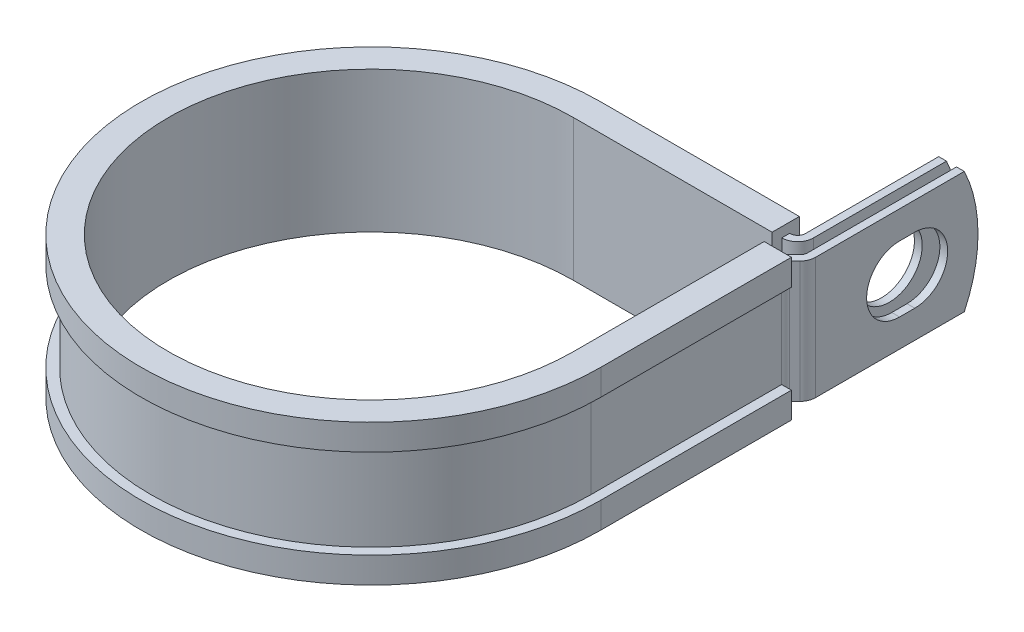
ISO-10303-21;
HEADER;
FILE_DESCRIPTION(('STEP AP214'),'2;1');
FILE_NAME('part.step','',(''),(''),'','','');
FILE_SCHEMA(('AUTOMOTIVE_DESIGN { 1 0 10303 214 1 1 1 1 }'));
ENDSEC;
DATA;
#1=APPLICATION_CONTEXT('core data for automotive mechanical design processes');
#2=APPLICATION_PROTOCOL_DEFINITION('international standard','automotive_design',2000,#1);
#3=PRODUCT_CONTEXT('',#1,'mechanical');
#4=PRODUCT('Part','Part','',(#3));
#5=PRODUCT_RELATED_PRODUCT_CATEGORY('part','',(#4));
#6=PRODUCT_DEFINITION_FORMATION('','',#4);
#7=PRODUCT_DEFINITION_CONTEXT('part definition',#1,'design');
#8=PRODUCT_DEFINITION('design','',#6,#7);
#9=PRODUCT_DEFINITION_SHAPE('','',#8);
#10=(LENGTH_UNIT() NAMED_UNIT(*) SI_UNIT(.MILLI.,.METRE.));
#11=(NAMED_UNIT(*) PLANE_ANGLE_UNIT() SI_UNIT($,.RADIAN.));
#12=(NAMED_UNIT(*) SI_UNIT($,.STERADIAN.) SOLID_ANGLE_UNIT());
#13=UNCERTAINTY_MEASURE_WITH_UNIT(LENGTH_MEASURE(1.E-05),#10,'distance_accuracy_value','');
#14=(GEOMETRIC_REPRESENTATION_CONTEXT(3) GLOBAL_UNCERTAINTY_ASSIGNED_CONTEXT((#13)) GLOBAL_UNIT_ASSIGNED_CONTEXT((#10,
#11,#12)) REPRESENTATION_CONTEXT('',''));
#15=CARTESIAN_POINT('',(0.,0.,0.));
#16=DIRECTION('',(0.,0.,1.));
#17=DIRECTION('',(1.,0.,0.));
#18=AXIS2_PLACEMENT_3D('',#15,#16,#17);
#19=CARTESIAN_POINT('',(33.9522698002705,-9.525,-33.274));
#20=DIRECTION('',(0.,1.,0.));
#21=DIRECTION('',(1.,0.,0.));
#22=AXIS2_PLACEMENT_3D('',#19,#20,#21);
#23=PLANE('',#22);
#24=DIRECTION('',(0.,0.,-1.));
#25=VECTOR('',#24,1.);
#26=CARTESIAN_POINT('',(31.1074698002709,-9.525,-33.274));
#27=LINE('',#26,#25);
#28=CARTESIAN_POINT('',(31.1074698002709,-9.525,-33.274));
#29=VERTEX_POINT('',#28);
#30=CARTESIAN_POINT('',(31.1074698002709,-9.525,-34.4932));
#31=VERTEX_POINT('',#30);
#32=EDGE_CURVE('E523',#29,#31,#27,.T.);
#33=ORIENTED_EDGE('',*,*,#32,.T.);
#34=DIRECTION('',(1.,0.,0.));
#35=VECTOR('',#34,1.);
#36=CARTESIAN_POINT('',(0.,-9.525,-34.4932));
#37=LINE('',#36,#35);
#38=CARTESIAN_POINT('',(31.1582698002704,-9.525,-34.4932));
#39=VERTEX_POINT('',#38);
#40=EDGE_CURVE('E410',#39,#31,#37,.F.);
#41=ORIENTED_EDGE('',*,*,#40,.F.);
#42=CARTESIAN_POINT('',(31.1582698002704,-9.525,-35.7124));
#43=DIRECTION('',(0.,1.,0.));
#44=DIRECTION('',(1.,0.,0.));
#45=AXIS2_PLACEMENT_3D('',#42,#43,#44);
#46=CIRCLE('',#45,1.2192);
#47=CARTESIAN_POINT('',(32.3774698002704,-9.525,-35.7124));
#48=VERTEX_POINT('',#47);
#49=EDGE_CURVE('E408',#48,#39,#46,.F.);
#50=ORIENTED_EDGE('',*,*,#49,.F.);
#51=DIRECTION('',(0.,0.,1.));
#52=VECTOR('',#51,1.);
#53=CARTESIAN_POINT('',(32.3774698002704,-9.525,-58.7248));
#54=LINE('',#53,#52);
#55=CARTESIAN_POINT('',(32.3774698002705,-9.525,-56.5802631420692));
#56=VERTEX_POINT('',#55);
#57=EDGE_CURVE('E406',#56,#48,#54,.T.);
#58=ORIENTED_EDGE('',*,*,#57,.F.);
#59=DIRECTION('',(-1.,0.,0.));
#60=VECTOR('',#59,1.);
#61=CARTESIAN_POINT('',(36.3906698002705,-9.525,-56.5802631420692));
#62=LINE('',#61,#60);
#63=CARTESIAN_POINT('',(33.5966698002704,-9.525,-56.5802631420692));
#64=VERTEX_POINT('',#63);
#65=EDGE_CURVE('E12',#64,#56,#62,.T.);
#66=ORIENTED_EDGE('',*,*,#65,.F.);
#67=DIRECTION('',(0.,0.,1.));
#68=VECTOR('',#67,1.);
#69=CARTESIAN_POINT('',(33.5966698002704,-9.525,-58.7248));
#70=LINE('',#69,#68);
#71=CARTESIAN_POINT('',(33.5966698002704,-9.525,-35.7124));
#72=VERTEX_POINT('',#71);
#73=EDGE_CURVE('E404',#64,#72,#70,.T.);
#74=ORIENTED_EDGE('',*,*,#73,.T.);
#75=CARTESIAN_POINT('',(31.1582698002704,-9.525,-35.7124));
#76=DIRECTION('',(0.,-1.,0.));
#77=DIRECTION('',(0.,0.,1.));
#78=AXIS2_PLACEMENT_3D('',#75,#76,#77);
#79=CIRCLE('',#78,2.4384);
#80=CARTESIAN_POINT('',(31.1582698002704,-9.525,-33.274));
#81=VERTEX_POINT('',#80);
#82=EDGE_CURVE('E401',#72,#81,#79,.T.);
#83=ORIENTED_EDGE('',*,*,#82,.T.);
#84=DIRECTION('',(-1.,0.,0.));
#85=VECTOR('',#84,1.);
#86=CARTESIAN_POINT('',(0.,-9.525,-33.274));
#87=LINE('',#86,#85);
#88=EDGE_CURVE('E398',#81,#29,#87,.T.);
#89=ORIENTED_EDGE('',*,*,#88,.T.);
#90=EDGE_LOOP('',(#33,#41,#50,#58,#66,#74,#83,#89));
#91=FACE_BOUND('',#90,.T.);
#92=ADVANCED_FACE('F54',(#91),#23,.F.);
#93=CARTESIAN_POINT('',(33.9522698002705,9.525,-33.274));
#94=DIRECTION('',(0.,1.,0.));
#95=DIRECTION('',(1.,0.,0.));
#96=AXIS2_PLACEMENT_3D('',#93,#94,#95);
#97=PLANE('',#96);
#98=DIRECTION('',(1.,0.,0.));
#99=VECTOR('',#98,1.);
#100=CARTESIAN_POINT('',(0.,9.525,-34.4932));
#101=LINE('',#100,#99);
#102=CARTESIAN_POINT('',(31.1582698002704,9.525,-34.4932));
#103=VERTEX_POINT('',#102);
#104=CARTESIAN_POINT('',(31.1074698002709,9.525,-34.4932));
#105=VERTEX_POINT('',#104);
#106=EDGE_CURVE('E368',#103,#105,#101,.F.);
#107=ORIENTED_EDGE('',*,*,#106,.T.);
#108=DIRECTION('',(0.,0.,1.));
#109=VECTOR('',#108,1.);
#110=CARTESIAN_POINT('',(31.1074698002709,9.525,-34.4932));
#111=LINE('',#110,#109);
#112=CARTESIAN_POINT('',(31.1074698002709,9.525,-33.274));
#113=VERTEX_POINT('',#112);
#114=EDGE_CURVE('E517',#105,#113,#111,.T.);
#115=ORIENTED_EDGE('',*,*,#114,.T.);
#116=DIRECTION('',(-1.,0.,0.));
#117=VECTOR('',#116,1.);
#118=CARTESIAN_POINT('',(0.,9.525,-33.274));
#119=LINE('',#118,#117);
#120=CARTESIAN_POINT('',(31.1582698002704,9.525,-33.274));
#121=VERTEX_POINT('',#120);
#122=EDGE_CURVE('E625',#121,#113,#119,.T.);
#123=ORIENTED_EDGE('',*,*,#122,.F.);
#124=CARTESIAN_POINT('',(31.1582698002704,9.525,-35.7124));
#125=DIRECTION('',(0.,-1.,0.));
#126=DIRECTION('',(0.,0.,1.));
#127=AXIS2_PLACEMENT_3D('',#124,#125,#126);
#128=CIRCLE('',#127,2.4384);
#129=CARTESIAN_POINT('',(33.5966698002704,9.525,-35.7124));
#130=VERTEX_POINT('',#129);
#131=EDGE_CURVE('E370',#130,#121,#128,.T.);
#132=ORIENTED_EDGE('',*,*,#131,.F.);
#133=DIRECTION('',(0.,0.,1.));
#134=VECTOR('',#133,1.);
#135=CARTESIAN_POINT('',(33.5966698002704,9.525,-58.7248));
#136=LINE('',#135,#134);
#137=CARTESIAN_POINT('',(33.5966698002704,9.525,-56.5802631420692));
#138=VERTEX_POINT('',#137);
#139=EDGE_CURVE('E361',#138,#130,#136,.T.);
#140=ORIENTED_EDGE('',*,*,#139,.F.);
#141=DIRECTION('',(-1.,0.,0.));
#142=VECTOR('',#141,1.);
#143=CARTESIAN_POINT('',(36.3906698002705,9.525,-56.5802631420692));
#144=LINE('',#143,#142);
#145=CARTESIAN_POINT('',(32.3774698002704,9.525,-56.5802631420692));
#146=VERTEX_POINT('',#145);
#147=EDGE_CURVE('E62',#138,#146,#144,.T.);
#148=ORIENTED_EDGE('',*,*,#147,.T.);
#149=DIRECTION('',(0.,0.,1.));
#150=VECTOR('',#149,1.);
#151=CARTESIAN_POINT('',(32.3774698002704,9.525,-58.7248));
#152=LINE('',#151,#150);
#153=CARTESIAN_POINT('',(32.3774698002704,9.525,-35.7124));
#154=VERTEX_POINT('',#153);
#155=EDGE_CURVE('E358',#146,#154,#152,.T.);
#156=ORIENTED_EDGE('',*,*,#155,.T.);
#157=CARTESIAN_POINT('',(31.1582698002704,9.525,-35.7124));
#158=DIRECTION('',(0.,1.,0.));
#159=DIRECTION('',(1.,0.,0.));
#160=AXIS2_PLACEMENT_3D('',#157,#158,#159);
#161=CIRCLE('',#160,1.2192);
#162=EDGE_CURVE('E366',#154,#103,#161,.F.);
#163=ORIENTED_EDGE('',*,*,#162,.T.);
#164=EDGE_LOOP('',(#107,#115,#123,#132,#140,#148,#156,#163));
#165=FACE_BOUND('',#164,.T.);
#166=ADVANCED_FACE('F357',(#165),#97,.T.);
#167=CARTESIAN_POINT('',(0.,9.525,-33.274));
#168=DIRECTION('',(0.,0.,1.));
#169=DIRECTION('',(1.,0.,0.));
#170=AXIS2_PLACEMENT_3D('',#167,#168,#169);
#171=PLANE('',#170);
#172=ORIENTED_EDGE('',*,*,#122,.T.);
#173=DIRECTION('',(0.,-1.,0.));
#174=VECTOR('',#173,1.);
#175=CARTESIAN_POINT('',(31.1074698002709,9.525,-33.274));
#176=LINE('',#175,#174);
#177=EDGE_CURVE('E520',#113,#29,#176,.T.);
#178=ORIENTED_EDGE('',*,*,#177,.T.);
#179=ORIENTED_EDGE('',*,*,#88,.F.);
#180=DIRECTION('',(0.,-1.,0.));
#181=VECTOR('',#180,1.);
#182=CARTESIAN_POINT('',(31.1582698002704,9.525,-33.274));
#183=LINE('',#182,#181);
#184=EDGE_CURVE('E344',#121,#81,#183,.T.);
#185=ORIENTED_EDGE('',*,*,#184,.F.);
#186=EDGE_LOOP('',(#172,#178,#179,#185));
#187=FACE_BOUND('',#186,.T.);
#188=ADVANCED_FACE('F635',(#187),#171,.T.);
#189=CARTESIAN_POINT('',(36.3906698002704,9.525,-33.274));
#190=DIRECTION('',(-1.,0.,0.));
#191=DIRECTION('',(0.,0.,1.));
#192=AXIS2_PLACEMENT_3D('',#189,#190,#191);
#193=PLANE('',#192);
#194=CARTESIAN_POINT('',(36.3906698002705,0.,-48.8187999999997));
#195=DIRECTION('',(1.,0.,0.));
#196=DIRECTION('',(0.,0.,-1.));
#197=AXIS2_PLACEMENT_3D('',#194,#195,#196);
#198=CIRCLE('',#197,5.1562);
#199=CARTESIAN_POINT('',(36.3906698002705,-5.1562,-48.8188000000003));
#200=VERTEX_POINT('',#199);
#201=CARTESIAN_POINT('',(36.3906698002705,5.1562,-48.8188000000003));
#202=VERTEX_POINT('',#201);
#203=EDGE_CURVE('E580',#200,#202,#198,.T.);
#204=ORIENTED_EDGE('',*,*,#203,.F.);
#205=DIRECTION('',(0.,0.,-1.));
#206=VECTOR('',#205,1.);
#207=CARTESIAN_POINT('',(36.3906698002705,-5.1562,-46.4311999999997));
#208=LINE('',#207,#206);
#209=CARTESIAN_POINT('',(36.3906698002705,-5.1562,-46.4311999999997));
#210=VERTEX_POINT('',#209);
#211=EDGE_CURVE('E583',#210,#200,#208,.T.);
#212=ORIENTED_EDGE('',*,*,#211,.F.);
#213=CARTESIAN_POINT('',(36.3906698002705,0.,-46.4311999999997));
#214=DIRECTION('',(1.,0.,0.));
#215=DIRECTION('',(0.,0.,-1.));
#216=AXIS2_PLACEMENT_3D('',#213,#214,#215);
#217=CIRCLE('',#216,5.1562);
#218=CARTESIAN_POINT('',(36.3906698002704,5.1562,-46.4311999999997));
#219=VERTEX_POINT('',#218);
#220=EDGE_CURVE('E576',#219,#210,#217,.T.);
#221=ORIENTED_EDGE('',*,*,#220,.F.);
#222=DIRECTION('',(0.,0.,1.));
#223=VECTOR('',#222,1.);
#224=CARTESIAN_POINT('',(36.3906698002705,5.1562,-46.4311999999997));
#225=LINE('',#224,#223);
#226=EDGE_CURVE('E577',#202,#219,#225,.T.);
#227=ORIENTED_EDGE('',*,*,#226,.F.);
#228=EDGE_LOOP('',(#204,#212,#221,#227));
#229=FACE_BOUND('',#228,.T.);
#230=DIRECTION('',(0.,0.,-1.));
#231=VECTOR('',#230,1.);
#232=CARTESIAN_POINT('',(36.3906698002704,-9.525,-33.274));
#233=LINE('',#232,#231);
#234=CARTESIAN_POINT('',(36.3906698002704,-9.525,-33.274));
#235=VERTEX_POINT('',#234);
#236=CARTESIAN_POINT('',(36.3906698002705,-9.525,-56.5802631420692));
#237=VERTEX_POINT('',#236);
#238=EDGE_CURVE('E382',#235,#237,#233,.T.);
#239=ORIENTED_EDGE('',*,*,#238,.T.);
#240=CARTESIAN_POINT('',(36.3906698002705,0.,-36.4998));
#241=DIRECTION('',(-1.,0.,0.));
#242=DIRECTION('',(0.,0.,1.));
#243=AXIS2_PLACEMENT_3D('',#240,#241,#242);
#244=CIRCLE('',#243,22.225);
#245=CARTESIAN_POINT('',(36.3906698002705,9.525,-56.5802631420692));
#246=VERTEX_POINT('',#245);
#247=EDGE_CURVE('E568',#246,#237,#244,.T.);
#248=ORIENTED_EDGE('',*,*,#247,.F.);
#249=DIRECTION('',(0.,0.,-1.));
#250=VECTOR('',#249,1.);
#251=CARTESIAN_POINT('',(36.3906698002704,9.525,-33.274));
#252=LINE('',#251,#250);
#253=CARTESIAN_POINT('',(36.3906698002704,9.525,-33.274));
#254=VERTEX_POINT('',#253);
#255=EDGE_CURVE('E419',#254,#246,#252,.T.);
#256=ORIENTED_EDGE('',*,*,#255,.F.);
#257=DIRECTION('',(0.,-1.,0.));
#258=VECTOR('',#257,1.);
#259=CARTESIAN_POINT('',(36.3906698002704,9.525,-33.274));
#260=LINE('',#259,#258);
#261=EDGE_CURVE('E381',#254,#235,#260,.T.);
#262=ORIENTED_EDGE('',*,*,#261,.T.);
#263=EDGE_LOOP('',(#239,#248,#256,#262));
#264=FACE_BOUND('',#263,.T.);
#265=ADVANCED_FACE('F56',(#229,#264),#193,.F.);
#266=CARTESIAN_POINT('',(35.1714698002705,9.525,-33.274));
#267=DIRECTION('',(-1.,0.,0.));
#268=DIRECTION('',(0.,0.,1.));
#269=AXIS2_PLACEMENT_3D('',#266,#267,#268);
#270=PLANE('',#269);
#271=DIRECTION('',(0.,0.,-1.));
#272=VECTOR('',#271,1.);
#273=CARTESIAN_POINT('',(35.1714698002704,-5.1562,-46.4311999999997));
#274=LINE('',#273,#272);
#275=CARTESIAN_POINT('',(35.1714698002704,-5.1562,-46.4311999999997));
#276=VERTEX_POINT('',#275);
#277=CARTESIAN_POINT('',(35.1714698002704,-5.1562,-48.8188000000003));
#278=VERTEX_POINT('',#277);
#279=EDGE_CURVE('E579',#276,#278,#274,.T.);
#280=ORIENTED_EDGE('',*,*,#279,.T.);
#281=CARTESIAN_POINT('',(35.1714698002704,0.,-48.8187999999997));
#282=DIRECTION('',(-1.,0.,0.));
#283=DIRECTION('',(0.,0.,1.));
#284=AXIS2_PLACEMENT_3D('',#281,#282,#283);
#285=CIRCLE('',#284,5.1562);
#286=CARTESIAN_POINT('',(35.1714698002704,5.1562,-48.8188000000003));
#287=VERTEX_POINT('',#286);
#288=EDGE_CURVE('E600',#278,#287,#285,.F.);
#289=ORIENTED_EDGE('',*,*,#288,.T.);
#290=DIRECTION('',(0.,0.,1.));
#291=VECTOR('',#290,1.);
#292=CARTESIAN_POINT('',(35.1714698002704,5.1562,-46.4311999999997));
#293=LINE('',#292,#291);
#294=CARTESIAN_POINT('',(35.1714698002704,5.1562,-46.4311999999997));
#295=VERTEX_POINT('',#294);
#296=EDGE_CURVE('E596',#287,#295,#293,.T.);
#297=ORIENTED_EDGE('',*,*,#296,.T.);
#298=CARTESIAN_POINT('',(35.1714698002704,0.,-46.4311999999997));
#299=DIRECTION('',(-1.,0.,0.));
#300=DIRECTION('',(0.,0.,1.));
#301=AXIS2_PLACEMENT_3D('',#298,#299,#300);
#302=CIRCLE('',#301,5.1562);
#303=EDGE_CURVE('E591',#295,#276,#302,.F.);
#304=ORIENTED_EDGE('',*,*,#303,.T.);
#305=EDGE_LOOP('',(#280,#289,#297,#304));
#306=FACE_BOUND('',#305,.T.);
#307=CARTESIAN_POINT('',(35.1714698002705,0.,-36.4998));
#308=DIRECTION('',(-1.,0.,0.));
#309=DIRECTION('',(0.,0.,1.));
#310=AXIS2_PLACEMENT_3D('',#307,#308,#309);
#311=CIRCLE('',#310,22.225);
#312=CARTESIAN_POINT('',(35.1714698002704,9.525,-56.5802631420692));
#313=VERTEX_POINT('',#312);
#314=CARTESIAN_POINT('',(35.1714698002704,-9.525,-56.5802631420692));
#315=VERTEX_POINT('',#314);
#316=EDGE_CURVE('E76',#313,#315,#311,.T.);
#317=ORIENTED_EDGE('',*,*,#316,.T.);
#318=DIRECTION('',(0.,0.,-1.));
#319=VECTOR('',#318,1.);
#320=CARTESIAN_POINT('',(35.1714698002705,-9.525,-33.274));
#321=LINE('',#320,#319);
#322=CARTESIAN_POINT('',(35.1714698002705,-9.525,-33.274));
#323=VERTEX_POINT('',#322);
#324=EDGE_CURVE('E385',#323,#315,#321,.T.);
#325=ORIENTED_EDGE('',*,*,#324,.F.);
#326=DIRECTION('',(0.,-1.,0.));
#327=VECTOR('',#326,1.);
#328=CARTESIAN_POINT('',(35.1714698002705,9.525,-33.274));
#329=LINE('',#328,#327);
#330=CARTESIAN_POINT('',(35.1714698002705,9.525,-33.274));
#331=VERTEX_POINT('',#330);
#332=EDGE_CURVE('E352',#331,#323,#329,.T.);
#333=ORIENTED_EDGE('',*,*,#332,.F.);
#334=DIRECTION('',(0.,0.,-1.));
#335=VECTOR('',#334,1.);
#336=CARTESIAN_POINT('',(35.1714698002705,9.525,-33.274));
#337=LINE('',#336,#335);
#338=EDGE_CURVE('E615',#331,#313,#337,.T.);
#339=ORIENTED_EDGE('',*,*,#338,.T.);
#340=EDGE_LOOP('',(#317,#325,#333,#339));
#341=FACE_BOUND('',#340,.T.);
#342=ADVANCED_FACE('F689',(#306,#341),#270,.T.);
#343=CARTESIAN_POINT('',(33.5966698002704,9.525,-58.7248));
#344=DIRECTION('',(1.,0.,0.));
#345=DIRECTION('',(0.,0.,-1.));
#346=AXIS2_PLACEMENT_3D('',#343,#344,#345);
#347=PLANE('',#346);
#348=CARTESIAN_POINT('',(33.5966698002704,0.,-47.625));
#349=DIRECTION('',(1.,0.,0.));
#350=DIRECTION('',(0.,0.,-1.));
#351=AXIS2_PLACEMENT_3D('',#348,#349,#350);
#352=CIRCLE('',#351,5.1562);
#353=CARTESIAN_POINT('',(33.5966698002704,0.,-52.7812));
#354=VERTEX_POINT('',#353);
#355=EDGE_CURVE('E386',#354,#354,#352,.F.);
#356=ORIENTED_EDGE('',*,*,#355,.T.);
#357=EDGE_LOOP('',(#356));
#358=FACE_BOUND('',#357,.T.);
#359=ORIENTED_EDGE('',*,*,#73,.F.);
#360=CARTESIAN_POINT('',(33.5966698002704,0.,-36.4998));
#361=DIRECTION('',(1.,0.,0.));
#362=DIRECTION('',(0.,0.,-1.));
#363=AXIS2_PLACEMENT_3D('',#360,#361,#362);
#364=CIRCLE('',#363,22.225);
#365=EDGE_CURVE('E573',#64,#138,#364,.T.);
#366=ORIENTED_EDGE('',*,*,#365,.T.);
#367=ORIENTED_EDGE('',*,*,#139,.T.);
#368=DIRECTION('',(0.,-1.,0.));
#369=VECTOR('',#368,1.);
#370=CARTESIAN_POINT('',(33.5966698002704,9.525,-35.7124));
#371=LINE('',#370,#369);
#372=EDGE_CURVE('E341',#130,#72,#371,.T.);
#373=ORIENTED_EDGE('',*,*,#372,.T.);
#374=EDGE_LOOP('',(#359,#366,#367,#373));
#375=FACE_BOUND('',#374,.T.);
#376=ADVANCED_FACE('F641',(#358,#375),#347,.T.);
#377=CARTESIAN_POINT('',(32.3774698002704,9.525,-58.7248));
#378=DIRECTION('',(1.,0.,0.));
#379=DIRECTION('',(0.,0.,-1.));
#380=AXIS2_PLACEMENT_3D('',#377,#378,#379);
#381=PLANE('',#380);
#382=CARTESIAN_POINT('',(32.3774698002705,0.,-47.625));
#383=DIRECTION('',(-1.,0.,0.));
#384=DIRECTION('',(0.,0.,1.));
#385=AXIS2_PLACEMENT_3D('',#382,#383,#384);
#386=CIRCLE('',#385,5.1562);
#387=CARTESIAN_POINT('',(32.3774698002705,0.,-42.4688));
#388=VERTEX_POINT('',#387);
#389=EDGE_CURVE('E608',#388,#388,#386,.T.);
#390=ORIENTED_EDGE('',*,*,#389,.F.);
#391=EDGE_LOOP('',(#390));
#392=FACE_BOUND('',#391,.T.);
#393=CARTESIAN_POINT('',(32.3774698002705,0.,-36.4998));
#394=DIRECTION('',(-1.,0.,0.));
#395=DIRECTION('',(0.,0.,1.));
#396=AXIS2_PLACEMENT_3D('',#393,#394,#395);
#397=CIRCLE('',#396,22.225);
#398=EDGE_CURVE('E68',#146,#56,#397,.T.);
#399=ORIENTED_EDGE('',*,*,#398,.T.);
#400=ORIENTED_EDGE('',*,*,#57,.T.);
#401=DIRECTION('',(0.,-1.,0.));
#402=VECTOR('',#401,1.);
#403=CARTESIAN_POINT('',(32.3774698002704,9.525,-35.7124));
#404=LINE('',#403,#402);
#405=EDGE_CURVE('E338',#154,#48,#404,.T.);
#406=ORIENTED_EDGE('',*,*,#405,.F.);
#407=ORIENTED_EDGE('',*,*,#155,.F.);
#408=EDGE_LOOP('',(#399,#400,#406,#407));
#409=FACE_BOUND('',#408,.T.);
#410=ADVANCED_FACE('F364',(#392,#409),#381,.F.);
#411=CARTESIAN_POINT('',(35.7124,-9.525,-29.8615026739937));
#412=DIRECTION('',(0.,1.,0.));
#413=DIRECTION('',(1.,0.,0.));
#414=AXIS2_PLACEMENT_3D('',#411,#412,#413);
#415=CIRCLE('',#414,1.21919999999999);
#416=CARTESIAN_POINT('',(34.4932,-9.525,-29.8615026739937));
#417=VERTEX_POINT('',#416);
#418=CARTESIAN_POINT('',(34.8502954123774,-9.525,-30.7236072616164));
#419=VERTEX_POINT('',#418);
#420=EDGE_CURVE('E413',#417,#419,#415,.F.);
#421=ORIENTED_EDGE('',*,*,#420,.F.);
#422=DIRECTION('',(1.,0.,0.));
#423=VECTOR('',#422,1.);
#424=CARTESIAN_POINT('',(33.274,-9.525,-29.8615026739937));
#425=LINE('',#424,#423);
#426=CARTESIAN_POINT('',(33.274,-9.525,-29.8615026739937));
#427=VERTEX_POINT('',#426);
#428=EDGE_CURVE('E451',#427,#417,#425,.T.);
#429=ORIENTED_EDGE('',*,*,#428,.F.);
#430=CARTESIAN_POINT('',(35.7124,-9.525,-29.8615026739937));
#431=DIRECTION('',(0.,-1.,0.));
#432=DIRECTION('',(0.,0.,1.));
#433=AXIS2_PLACEMENT_3D('',#430,#431,#432);
#434=CIRCLE('',#433,2.43839999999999);
#435=CARTESIAN_POINT('',(33.9881908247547,-9.525,-31.585711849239));
#436=VERTEX_POINT('',#435);
#437=EDGE_CURVE('E395',#427,#436,#434,.T.);
#438=ORIENTED_EDGE('',*,*,#437,.T.);
#439=DIRECTION('',(0.707106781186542,0.,-0.707106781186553));
#440=VECTOR('',#439,1.);
#441=CARTESIAN_POINT('',(33.9881908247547,-9.525,-31.585711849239));
#442=LINE('',#441,#440);
#443=CARTESIAN_POINT('',(34.8143743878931,-9.525,-32.4118954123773));
#444=VERTEX_POINT('',#443);
#445=EDGE_CURVE('E392',#436,#444,#442,.T.);
#446=ORIENTED_EDGE('',*,*,#445,.T.);
#447=CARTESIAN_POINT('',(33.9522698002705,-9.525,-33.274));
#448=DIRECTION('',(0.,1.,0.));
#449=DIRECTION('',(0.,0.,1.));
#450=AXIS2_PLACEMENT_3D('',#447,#448,#449);
#451=CIRCLE('',#450,1.2192);
#452=EDGE_CURVE('E389',#444,#323,#451,.T.);
#453=ORIENTED_EDGE('',*,*,#452,.T.);
#454=ORIENTED_EDGE('',*,*,#324,.T.);
#455=DIRECTION('',(-1.,0.,0.));
#456=VECTOR('',#455,1.);
#457=CARTESIAN_POINT('',(36.3906698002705,-9.525,-56.5802631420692));
#458=LINE('',#457,#456);
#459=EDGE_CURVE('E566',#237,#315,#458,.T.);
#460=ORIENTED_EDGE('',*,*,#459,.F.);
#461=ORIENTED_EDGE('',*,*,#238,.F.);
#462=CARTESIAN_POINT('',(33.9522698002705,-9.525,-33.274));
#463=DIRECTION('',(0.,1.,0.));
#464=DIRECTION('',(1.,0.,0.));
#465=AXIS2_PLACEMENT_3D('',#462,#463,#464);
#466=CIRCLE('',#465,2.4384);
#467=CARTESIAN_POINT('',(35.6764789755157,-9.525,-31.5497908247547));
#468=VERTEX_POINT('',#467);
#469=EDGE_CURVE('E417',#468,#235,#466,.T.);
#470=ORIENTED_EDGE('',*,*,#469,.F.);
#471=DIRECTION('',(0.707106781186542,0.,-0.707106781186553));
#472=VECTOR('',#471,1.);
#473=CARTESIAN_POINT('',(34.8502954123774,-9.525,-30.7236072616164));
#474=LINE('',#473,#472);
#475=EDGE_CURVE('E415',#419,#468,#474,.T.);
#476=ORIENTED_EDGE('',*,*,#475,.F.);
#477=EDGE_LOOP('',(#421,#429,#438,#446,#453,#454,#460,#461,#470,#476));
#478=FACE_BOUND('',#477,.T.);
#479=ADVANCED_FACE('F675',(#478),#23,.F.);
#480=DIRECTION('',(-1.,0.,0.));
#481=VECTOR('',#480,1.);
#482=CARTESIAN_POINT('',(34.4932,9.525,-29.8615026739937));
#483=LINE('',#482,#481);
#484=CARTESIAN_POINT('',(34.4932,9.525,-29.8615026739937));
#485=VERTEX_POINT('',#484);
#486=CARTESIAN_POINT('',(33.274,9.525,-29.8615026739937));
#487=VERTEX_POINT('',#486);
#488=EDGE_CURVE('E440',#485,#487,#483,.T.);
#489=ORIENTED_EDGE('',*,*,#488,.F.);
#490=CARTESIAN_POINT('',(35.7124,9.525,-29.8615026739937));
#491=DIRECTION('',(0.,1.,0.));
#492=DIRECTION('',(1.,0.,0.));
#493=AXIS2_PLACEMENT_3D('',#490,#491,#492);
#494=CIRCLE('',#493,1.21919999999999);
#495=CARTESIAN_POINT('',(34.8502954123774,9.525,-30.7236072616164));
#496=VERTEX_POINT('',#495);
#497=EDGE_CURVE('E375',#485,#496,#494,.F.);
#498=ORIENTED_EDGE('',*,*,#497,.T.);
#499=DIRECTION('',(0.707106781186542,0.,-0.707106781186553));
#500=VECTOR('',#499,1.);
#501=CARTESIAN_POINT('',(34.8502954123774,9.525,-30.7236072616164));
#502=LINE('',#501,#500);
#503=CARTESIAN_POINT('',(35.6764789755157,9.525,-31.5497908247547));
#504=VERTEX_POINT('',#503);
#505=EDGE_CURVE('E377',#496,#504,#502,.T.);
#506=ORIENTED_EDGE('',*,*,#505,.T.);
#507=CARTESIAN_POINT('',(33.9522698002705,9.525,-33.274));
#508=DIRECTION('',(0.,1.,0.));
#509=DIRECTION('',(1.,0.,0.));
#510=AXIS2_PLACEMENT_3D('',#507,#508,#509);
#511=CIRCLE('',#510,2.4384);
#512=EDGE_CURVE('E379',#504,#254,#511,.T.);
#513=ORIENTED_EDGE('',*,*,#512,.T.);
#514=ORIENTED_EDGE('',*,*,#255,.T.);
#515=DIRECTION('',(-1.,0.,0.));
#516=VECTOR('',#515,1.);
#517=CARTESIAN_POINT('',(36.3906698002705,9.525,-56.5802631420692));
#518=LINE('',#517,#516);
#519=EDGE_CURVE('E570',#246,#313,#518,.T.);
#520=ORIENTED_EDGE('',*,*,#519,.T.);
#521=ORIENTED_EDGE('',*,*,#338,.F.);
#522=CARTESIAN_POINT('',(33.9522698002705,9.525,-33.274));
#523=DIRECTION('',(0.,1.,0.));
#524=DIRECTION('',(0.,0.,1.));
#525=AXIS2_PLACEMENT_3D('',#522,#523,#524);
#526=CIRCLE('',#525,1.2192);
#527=CARTESIAN_POINT('',(34.8143743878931,9.525,-32.4118954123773));
#528=VERTEX_POINT('',#527);
#529=EDGE_CURVE('E618',#528,#331,#526,.T.);
#530=ORIENTED_EDGE('',*,*,#529,.F.);
#531=DIRECTION('',(0.707106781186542,0.,-0.707106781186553));
#532=VECTOR('',#531,1.);
#533=CARTESIAN_POINT('',(33.9881908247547,9.525,-31.585711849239));
#534=LINE('',#533,#532);
#535=CARTESIAN_POINT('',(33.9881908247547,9.525,-31.585711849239));
#536=VERTEX_POINT('',#535);
#537=EDGE_CURVE('E621',#536,#528,#534,.T.);
#538=ORIENTED_EDGE('',*,*,#537,.F.);
#539=CARTESIAN_POINT('',(35.7124,9.525,-29.8615026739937));
#540=DIRECTION('',(0.,-1.,0.));
#541=DIRECTION('',(0.,0.,1.));
#542=AXIS2_PLACEMENT_3D('',#539,#540,#541);
#543=CIRCLE('',#542,2.43839999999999);
#544=EDGE_CURVE('E450',#487,#536,#543,.T.);
#545=ORIENTED_EDGE('',*,*,#544,.F.);
#546=EDGE_LOOP('',(#489,#498,#506,#513,#514,#520,#521,#530,#538,#545));
#547=FACE_BOUND('',#546,.T.);
#548=ADVANCED_FACE('F447',(#547),#97,.T.);
#549=CARTESIAN_POINT('',(33.9522698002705,9.525,-33.274));
#550=DIRECTION('',(0.,-1.,0.));
#551=DIRECTION('',(0.,0.,-1.));
#552=AXIS2_PLACEMENT_3D('',#549,#550,#551);
#553=CYLINDRICAL_SURFACE('',#552,1.2192);
#554=ORIENTED_EDGE('',*,*,#452,.F.);
#555=DIRECTION('',(0.,-1.,0.));
#556=VECTOR('',#555,1.);
#557=CARTESIAN_POINT('',(34.8143743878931,9.525,-32.4118954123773));
#558=LINE('',#557,#556);
#559=EDGE_CURVE('E350',#528,#444,#558,.T.);
#560=ORIENTED_EDGE('',*,*,#559,.F.);
#561=ORIENTED_EDGE('',*,*,#529,.T.);
#562=ORIENTED_EDGE('',*,*,#332,.T.);
#563=EDGE_LOOP('',(#554,#560,#561,#562));
#564=FACE_BOUND('',#563,.T.);
#565=ADVANCED_FACE('F685',(#564),#553,.F.);
#566=CARTESIAN_POINT('',(33.9881908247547,9.525,-31.585711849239));
#567=DIRECTION('',(-0.707106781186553,0.,-0.707106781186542));
#568=DIRECTION('',(-0.707106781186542,0.,0.707106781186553));
#569=AXIS2_PLACEMENT_3D('',#566,#567,#568);
#570=PLANE('',#569);
#571=ORIENTED_EDGE('',*,*,#445,.F.);
#572=DIRECTION('',(0.,-1.,0.));
#573=VECTOR('',#572,1.);
#574=CARTESIAN_POINT('',(33.9881908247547,9.525,-31.585711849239));
#575=LINE('',#574,#573);
#576=EDGE_CURVE('E348',#536,#436,#575,.T.);
#577=ORIENTED_EDGE('',*,*,#576,.F.);
#578=ORIENTED_EDGE('',*,*,#537,.T.);
#579=ORIENTED_EDGE('',*,*,#559,.T.);
#580=EDGE_LOOP('',(#571,#577,#578,#579));
#581=FACE_BOUND('',#580,.T.);
#582=ADVANCED_FACE('F680',(#581),#570,.T.);
#583=CARTESIAN_POINT('',(35.7124,9.525,-29.8615026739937));
#584=DIRECTION('',(0.,-1.,0.));
#585=DIRECTION('',(0.,0.,-1.));
#586=AXIS2_PLACEMENT_3D('',#583,#584,#585);
#587=CYLINDRICAL_SURFACE('',#586,2.43839999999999);
#588=ORIENTED_EDGE('',*,*,#437,.F.);
#589=DIRECTION('',(0.,-1.,0.));
#590=VECTOR('',#589,1.);
#591=CARTESIAN_POINT('',(33.274,9.525,-29.8615026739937));
#592=LINE('',#591,#590);
#593=EDGE_CURVE('E346',#487,#427,#592,.T.);
#594=ORIENTED_EDGE('',*,*,#593,.F.);
#595=ORIENTED_EDGE('',*,*,#544,.T.);
#596=ORIENTED_EDGE('',*,*,#576,.T.);
#597=EDGE_LOOP('',(#588,#594,#595,#596));
#598=FACE_BOUND('',#597,.T.);
#599=ADVANCED_FACE('F677',(#598),#587,.T.);
#600=CARTESIAN_POINT('',(31.1582698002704,9.525,-35.7124));
#601=DIRECTION('',(0.,-1.,0.));
#602=DIRECTION('',(0.,0.,-1.));
#603=AXIS2_PLACEMENT_3D('',#600,#601,#602);
#604=CYLINDRICAL_SURFACE('',#603,2.4384);
#605=ORIENTED_EDGE('',*,*,#82,.F.);
#606=ORIENTED_EDGE('',*,*,#372,.F.);
#607=ORIENTED_EDGE('',*,*,#131,.T.);
#608=ORIENTED_EDGE('',*,*,#184,.T.);
#609=EDGE_LOOP('',(#605,#606,#607,#608));
#610=FACE_BOUND('',#609,.T.);
#611=ADVANCED_FACE('F631',(#610),#604,.T.);
#612=CARTESIAN_POINT('',(31.1582698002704,9.525,-35.7124));
#613=DIRECTION('',(0.,-1.,0.));
#614=DIRECTION('',(0.,0.,-1.));
#615=AXIS2_PLACEMENT_3D('',#612,#613,#614);
#616=CYLINDRICAL_SURFACE('',#615,1.2192);
#617=ORIENTED_EDGE('',*,*,#49,.T.);
#618=DIRECTION('',(0.,-1.,0.));
#619=VECTOR('',#618,1.);
#620=CARTESIAN_POINT('',(31.1582698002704,9.525,-34.4932));
#621=LINE('',#620,#619);
#622=EDGE_CURVE('E329',#103,#39,#621,.T.);
#623=ORIENTED_EDGE('',*,*,#622,.F.);
#624=ORIENTED_EDGE('',*,*,#162,.F.);
#625=ORIENTED_EDGE('',*,*,#405,.T.);
#626=EDGE_LOOP('',(#617,#623,#624,#625));
#627=FACE_BOUND('',#626,.T.);
#628=ADVANCED_FACE('F646',(#627),#616,.F.);
#629=CARTESIAN_POINT('',(0.,9.525,-34.4932));
#630=DIRECTION('',(0.,0.,1.));
#631=DIRECTION('',(1.,0.,0.));
#632=AXIS2_PLACEMENT_3D('',#629,#630,#631);
#633=PLANE('',#632);
#634=DIRECTION('',(0.,-1.,0.));
#635=VECTOR('',#634,1.);
#636=CARTESIAN_POINT('',(0.,9.525,-34.4932));
#637=LINE('',#636,#635);
#638=CARTESIAN_POINT('',(4.83841555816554E-13,6.985,-34.4932));
#639=VERTEX_POINT('',#638);
#640=CARTESIAN_POINT('',(4.83841555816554E-13,-6.985,-34.4932));
#641=VERTEX_POINT('',#640);
#642=EDGE_CURVE('E320',#639,#641,#637,.T.);
#643=ORIENTED_EDGE('',*,*,#642,.F.);
#644=DIRECTION('',(1.,0.,0.));
#645=VECTOR('',#644,1.);
#646=CARTESIAN_POINT('',(4.83841555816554E-13,6.985,-34.4932));
#647=LINE('',#646,#645);
#648=CARTESIAN_POINT('',(31.1074698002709,6.985,-34.4932));
#649=VERTEX_POINT('',#648);
#650=EDGE_CURVE('E563',#639,#649,#647,.T.);
#651=ORIENTED_EDGE('',*,*,#650,.T.);
#652=DIRECTION('',(0.,1.,0.));
#653=VECTOR('',#652,1.);
#654=CARTESIAN_POINT('',(31.1074698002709,9.525,-34.4932));
#655=LINE('',#654,#653);
#656=EDGE_CURVE('E514',#649,#105,#655,.T.);
#657=ORIENTED_EDGE('',*,*,#656,.T.);
#658=ORIENTED_EDGE('',*,*,#106,.F.);
#659=ORIENTED_EDGE('',*,*,#622,.T.);
#660=ORIENTED_EDGE('',*,*,#40,.T.);
#661=DIRECTION('',(0.,1.,0.));
#662=VECTOR('',#661,1.);
#663=CARTESIAN_POINT('',(31.1074698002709,-9.525,-34.4932));
#664=LINE('',#663,#662);
#665=CARTESIAN_POINT('',(31.1074698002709,-6.985,-34.4932));
#666=VERTEX_POINT('',#665);
#667=EDGE_CURVE('E526',#31,#666,#664,.T.);
#668=ORIENTED_EDGE('',*,*,#667,.T.);
#669=DIRECTION('',(1.,0.,0.));
#670=VECTOR('',#669,1.);
#671=CARTESIAN_POINT('',(4.83841555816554E-13,-6.985,-34.4932));
#672=LINE('',#671,#670);
#673=EDGE_CURVE('E543',#641,#666,#672,.T.);
#674=ORIENTED_EDGE('',*,*,#673,.F.);
#675=EDGE_LOOP('',(#643,#651,#657,#658,#659,#660,#668,#674));
#676=FACE_BOUND('',#675,.T.);
#677=ADVANCED_FACE('F650',(#676),#633,.F.);
#678=CARTESIAN_POINT('',(0.,9.525,0.));
#679=DIRECTION('',(0.,-1.,0.));
#680=DIRECTION('',(0.,0.,-1.));
#681=AXIS2_PLACEMENT_3D('',#678,#679,#680);
#682=CYLINDRICAL_SURFACE('',#681,34.4932);
#683=DIRECTION('',(0.,-1.,0.));
#684=VECTOR('',#683,1.);
#685=CARTESIAN_POINT('',(34.4932,9.525,0.));
#686=LINE('',#685,#684);
#687=CARTESIAN_POINT('',(34.4932,6.985,0.));
#688=VERTEX_POINT('',#687);
#689=CARTESIAN_POINT('',(34.4932,-6.985,0.));
#690=VERTEX_POINT('',#689);
#691=EDGE_CURVE('E318',#688,#690,#686,.T.);
#692=ORIENTED_EDGE('',*,*,#691,.F.);
#693=CARTESIAN_POINT('',(0.,6.985,0.));
#694=DIRECTION('',(0.,-1.,0.));
#695=DIRECTION('',(0.,0.,-1.));
#696=AXIS2_PLACEMENT_3D('',#693,#694,#695);
#697=CIRCLE('',#696,34.4932);
#698=EDGE_CURVE('E512',#688,#639,#697,.T.);
#699=ORIENTED_EDGE('',*,*,#698,.T.);
#700=ORIENTED_EDGE('',*,*,#642,.T.);
#701=CARTESIAN_POINT('',(0.,-6.985,0.));
#702=DIRECTION('',(0.,-1.,0.));
#703=DIRECTION('',(0.,0.,-1.));
#704=AXIS2_PLACEMENT_3D('',#701,#702,#703);
#705=CIRCLE('',#704,34.4932);
#706=EDGE_CURVE('E301',#690,#641,#705,.T.);
#707=ORIENTED_EDGE('',*,*,#706,.F.);
#708=EDGE_LOOP('',(#692,#699,#700,#707));
#709=FACE_BOUND('',#708,.T.);
#710=ADVANCED_FACE('F316',(#709),#682,.T.);
#711=CARTESIAN_POINT('',(34.4932,9.525,0.));
#712=DIRECTION('',(-1.,0.,0.));
#713=DIRECTION('',(0.,0.,1.));
#714=AXIS2_PLACEMENT_3D('',#711,#712,#713);
#715=PLANE('',#714);
#716=DIRECTION('',(0.,-1.,0.));
#717=VECTOR('',#716,1.);
#718=CARTESIAN_POINT('',(34.4932,9.525,-29.8615026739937));
#719=LINE('',#718,#717);
#720=CARTESIAN_POINT('',(34.4932,6.985,-29.8615026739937));
#721=VERTEX_POINT('',#720);
#722=CARTESIAN_POINT('',(34.4932,-6.985,-29.8615026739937));
#723=VERTEX_POINT('',#722);
#724=EDGE_CURVE('E332',#721,#723,#719,.T.);
#725=ORIENTED_EDGE('',*,*,#724,.F.);
#726=DIRECTION('',(0.,0.,-1.));
#727=VECTOR('',#726,1.);
#728=CARTESIAN_POINT('',(34.4932,6.985,0.));
#729=LINE('',#728,#727);
#730=EDGE_CURVE('E326',#688,#721,#729,.T.);
#731=ORIENTED_EDGE('',*,*,#730,.F.);
#732=ORIENTED_EDGE('',*,*,#691,.T.);
#733=DIRECTION('',(0.,0.,-1.));
#734=VECTOR('',#733,1.);
#735=CARTESIAN_POINT('',(34.4932,-6.985,0.));
#736=LINE('',#735,#734);
#737=EDGE_CURVE('E297',#690,#723,#736,.T.);
#738=ORIENTED_EDGE('',*,*,#737,.T.);
#739=EDGE_LOOP('',(#725,#731,#732,#738));
#740=FACE_BOUND('',#739,.T.);
#741=ADVANCED_FACE('F325',(#740),#715,.F.);
#742=CARTESIAN_POINT('',(35.7124,9.525,-29.8615026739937));
#743=DIRECTION('',(0.,-1.,0.));
#744=DIRECTION('',(0.,0.,-1.));
#745=AXIS2_PLACEMENT_3D('',#742,#743,#744);
#746=CYLINDRICAL_SURFACE('',#745,1.21919999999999);
#747=ORIENTED_EDGE('',*,*,#420,.T.);
#748=DIRECTION('',(0.,-1.,0.));
#749=VECTOR('',#748,1.);
#750=CARTESIAN_POINT('',(34.8502954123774,9.525,-30.7236072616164));
#751=LINE('',#750,#749);
#752=EDGE_CURVE('E424',#496,#419,#751,.T.);
#753=ORIENTED_EDGE('',*,*,#752,.F.);
#754=ORIENTED_EDGE('',*,*,#497,.F.);
#755=EDGE_CURVE('E327',#485,#721,#719,.T.);
#756=ORIENTED_EDGE('',*,*,#755,.T.);
#757=ORIENTED_EDGE('',*,*,#724,.T.);
#758=DIRECTION('',(0.,1.,0.));
#759=VECTOR('',#758,1.);
#760=CARTESIAN_POINT('',(34.4932,-9.525,-29.8615026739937));
#761=LINE('',#760,#759);
#762=EDGE_CURVE('E433',#417,#723,#761,.T.);
#763=ORIENTED_EDGE('',*,*,#762,.F.);
#764=EDGE_LOOP('',(#747,#753,#754,#756,#757,#763));
#765=FACE_BOUND('',#764,.T.);
#766=ADVANCED_FACE('F432',(#765),#746,.F.);
#767=CARTESIAN_POINT('',(34.8502954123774,9.525,-30.7236072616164));
#768=DIRECTION('',(-0.707106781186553,0.,-0.707106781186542));
#769=DIRECTION('',(-0.707106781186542,0.,0.707106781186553));
#770=AXIS2_PLACEMENT_3D('',#767,#768,#769);
#771=PLANE('',#770);
#772=ORIENTED_EDGE('',*,*,#475,.T.);
#773=DIRECTION('',(0.,-1.,0.));
#774=VECTOR('',#773,1.);
#775=CARTESIAN_POINT('',(35.6764789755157,9.525,-31.5497908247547));
#776=LINE('',#775,#774);
#777=EDGE_CURVE('E422',#504,#468,#776,.T.);
#778=ORIENTED_EDGE('',*,*,#777,.F.);
#779=ORIENTED_EDGE('',*,*,#505,.F.);
#780=ORIENTED_EDGE('',*,*,#752,.T.);
#781=EDGE_LOOP('',(#772,#778,#779,#780));
#782=FACE_BOUND('',#781,.T.);
#783=ADVANCED_FACE('F701',(#782),#771,.F.);
#784=CARTESIAN_POINT('',(33.9522698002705,9.525,-33.274));
#785=DIRECTION('',(0.,-1.,0.));
#786=DIRECTION('',(0.,0.,-1.));
#787=AXIS2_PLACEMENT_3D('',#784,#785,#786);
#788=CYLINDRICAL_SURFACE('',#787,2.4384);
#789=ORIENTED_EDGE('',*,*,#469,.T.);
#790=ORIENTED_EDGE('',*,*,#261,.F.);
#791=ORIENTED_EDGE('',*,*,#512,.F.);
#792=ORIENTED_EDGE('',*,*,#777,.T.);
#793=EDGE_LOOP('',(#789,#790,#791,#792));
#794=FACE_BOUND('',#793,.T.);
#795=ADVANCED_FACE('F699',(#794),#788,.T.);
#796=CARTESIAN_POINT('',(48.1806057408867,0.,-47.625));
#797=DIRECTION('',(-1.,0.,0.));
#798=DIRECTION('',(0.,0.,1.));
#799=AXIS2_PLACEMENT_3D('',#796,#797,#798);
#800=CYLINDRICAL_SURFACE('',#799,5.1562);
#801=ORIENTED_EDGE('',*,*,#389,.T.);
#802=EDGE_LOOP('',(#801));
#803=FACE_BOUND('',#802,.T.);
#804=ORIENTED_EDGE('',*,*,#355,.F.);
#805=EDGE_LOOP('',(#804));
#806=FACE_BOUND('',#805,.T.);
#807=ADVANCED_FACE('F708',(#803,#806),#800,.F.);
#808=CARTESIAN_POINT('',(18.8118978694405,-5.1562,-46.4311999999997));
#809=DIRECTION('',(0.,-1.,0.));
#810=DIRECTION('',(0.,0.,-1.));
#811=AXIS2_PLACEMENT_3D('',#808,#809,#810);
#812=PLANE('',#811);
#813=DIRECTION('',(1.,0.,0.));
#814=VECTOR('',#813,1.);
#815=CARTESIAN_POINT('',(18.8118978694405,-5.1562,-46.4311999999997));
#816=LINE('',#815,#814);
#817=EDGE_CURVE('E594',#276,#210,#816,.T.);
#818=ORIENTED_EDGE('',*,*,#817,.T.);
#819=ORIENTED_EDGE('',*,*,#211,.T.);
#820=DIRECTION('',(1.,0.,0.));
#821=VECTOR('',#820,1.);
#822=CARTESIAN_POINT('',(18.8118978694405,-5.1562,-48.8188000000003));
#823=LINE('',#822,#821);
#824=EDGE_CURVE('E590',#278,#200,#823,.T.);
#825=ORIENTED_EDGE('',*,*,#824,.F.);
#826=ORIENTED_EDGE('',*,*,#279,.F.);
#827=EDGE_LOOP('',(#818,#819,#825,#826));
#828=FACE_BOUND('',#827,.T.);
#829=ADVANCED_FACE('F751',(#828),#812,.F.);
#830=CARTESIAN_POINT('',(18.8118978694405,0.,-48.8187999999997));
#831=DIRECTION('',(1.,0.,0.));
#832=DIRECTION('',(0.,0.,-1.));
#833=AXIS2_PLACEMENT_3D('',#830,#831,#832);
#834=CYLINDRICAL_SURFACE('',#833,5.1562);
#835=ORIENTED_EDGE('',*,*,#824,.T.);
#836=ORIENTED_EDGE('',*,*,#203,.T.);
#837=DIRECTION('',(1.,0.,0.));
#838=VECTOR('',#837,1.);
#839=CARTESIAN_POINT('',(18.8118978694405,5.1562,-48.8188000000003));
#840=LINE('',#839,#838);
#841=EDGE_CURVE('E599',#287,#202,#840,.T.);
#842=ORIENTED_EDGE('',*,*,#841,.F.);
#843=ORIENTED_EDGE('',*,*,#288,.F.);
#844=EDGE_LOOP('',(#835,#836,#842,#843));
#845=FACE_BOUND('',#844,.T.);
#846=ADVANCED_FACE('F755',(#845),#834,.F.);
#847=CARTESIAN_POINT('',(18.8118978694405,5.1562,-46.4311999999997));
#848=DIRECTION('',(0.,1.,0.));
#849=DIRECTION('',(0.,0.,1.));
#850=AXIS2_PLACEMENT_3D('',#847,#848,#849);
#851=PLANE('',#850);
#852=ORIENTED_EDGE('',*,*,#841,.T.);
#853=ORIENTED_EDGE('',*,*,#226,.T.);
#854=DIRECTION('',(1.,0.,0.));
#855=VECTOR('',#854,1.);
#856=CARTESIAN_POINT('',(18.8118978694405,5.1562,-46.4311999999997));
#857=LINE('',#856,#855);
#858=EDGE_CURVE('E595',#295,#219,#857,.T.);
#859=ORIENTED_EDGE('',*,*,#858,.F.);
#860=ORIENTED_EDGE('',*,*,#296,.F.);
#861=EDGE_LOOP('',(#852,#853,#859,#860));
#862=FACE_BOUND('',#861,.T.);
#863=ADVANCED_FACE('F759',(#862),#851,.F.);
#864=CARTESIAN_POINT('',(18.8118978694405,0.,-46.4311999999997));
#865=DIRECTION('',(1.,0.,0.));
#866=DIRECTION('',(0.,0.,-1.));
#867=AXIS2_PLACEMENT_3D('',#864,#865,#866);
#868=CYLINDRICAL_SURFACE('',#867,5.1562);
#869=ORIENTED_EDGE('',*,*,#858,.T.);
#870=ORIENTED_EDGE('',*,*,#220,.T.);
#871=ORIENTED_EDGE('',*,*,#817,.F.);
#872=ORIENTED_EDGE('',*,*,#303,.F.);
#873=EDGE_LOOP('',(#869,#870,#871,#872));
#874=FACE_BOUND('',#873,.T.);
#875=ADVANCED_FACE('F763',(#874),#868,.F.);
#876=CARTESIAN_POINT('',(36.3906698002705,0.,-36.4998));
#877=DIRECTION('',(-1.,0.,0.));
#878=DIRECTION('',(0.,0.,1.));
#879=AXIS2_PLACEMENT_3D('',#876,#877,#878);
#880=CYLINDRICAL_SURFACE('',#879,22.225);
#881=ORIENTED_EDGE('',*,*,#365,.F.);
#882=ORIENTED_EDGE('',*,*,#65,.T.);
#883=ORIENTED_EDGE('',*,*,#398,.F.);
#884=ORIENTED_EDGE('',*,*,#147,.F.);
#885=EDGE_LOOP('',(#881,#882,#883,#884));
#886=FACE_BOUND('',#885,.T.);
#887=ADVANCED_FACE('F642',(#886),#880,.T.);
#888=ORIENTED_EDGE('',*,*,#519,.F.);
#889=ORIENTED_EDGE('',*,*,#247,.T.);
#890=ORIENTED_EDGE('',*,*,#459,.T.);
#891=ORIENTED_EDGE('',*,*,#316,.F.);
#892=EDGE_LOOP('',(#888,#889,#890,#891));
#893=FACE_BOUND('',#892,.T.);
#894=ADVANCED_FACE('F690',(#893),#880,.T.);
#895=CARTESIAN_POINT('',(5.05218944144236E-13,11.049,-36.0172));
#896=DIRECTION('',(0.,0.,1.));
#897=DIRECTION('',(1.,0.,0.));
#898=AXIS2_PLACEMENT_3D('',#895,#896,#897);
#899=PLANE('',#898);
#900=DIRECTION('',(0.,-1.,0.));
#901=VECTOR('',#900,1.);
#902=CARTESIAN_POINT('',(5.05218944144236E-13,11.049,-36.0172));
#903=LINE('',#902,#901);
#904=CARTESIAN_POINT('',(5.05218944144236E-13,11.049,-36.0172));
#905=VERTEX_POINT('',#904);
#906=CARTESIAN_POINT('',(5.05218944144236E-13,6.985,-36.0172));
#907=VERTEX_POINT('',#906);
#908=EDGE_CURVE('E322',#905,#907,#903,.T.);
#909=ORIENTED_EDGE('',*,*,#908,.F.);
#910=DIRECTION('',(1.,0.,0.));
#911=VECTOR('',#910,1.);
#912=CARTESIAN_POINT('',(5.05218944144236E-13,11.049,-36.0172));
#913=LINE('',#912,#911);
#914=CARTESIAN_POINT('',(31.1074698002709,11.049,-36.0172));
#915=VERTEX_POINT('',#914);
#916=EDGE_CURVE('E557',#905,#915,#913,.T.);
#917=ORIENTED_EDGE('',*,*,#916,.T.);
#918=DIRECTION('',(0.,-1.,0.));
#919=VECTOR('',#918,1.);
#920=CARTESIAN_POINT('',(31.1074698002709,11.049,-36.0172));
#921=LINE('',#920,#919);
#922=CARTESIAN_POINT('',(31.1074698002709,6.985,-36.0172));
#923=VERTEX_POINT('',#922);
#924=EDGE_CURVE('E539',#915,#923,#921,.T.);
#925=ORIENTED_EDGE('',*,*,#924,.T.);
#926=DIRECTION('',(1.,0.,0.));
#927=VECTOR('',#926,1.);
#928=CARTESIAN_POINT('',(5.05218944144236E-13,6.985,-36.0172));
#929=LINE('',#928,#927);
#930=EDGE_CURVE('E560',#907,#923,#929,.T.);
#931=ORIENTED_EDGE('',*,*,#930,.F.);
#932=EDGE_LOOP('',(#909,#917,#925,#931));
#933=FACE_BOUND('',#932,.T.);
#934=ADVANCED_FACE('F854',(#933),#899,.F.);
#935=CARTESIAN_POINT('',(4.45362256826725E-13,11.049,-31.75));
#936=DIRECTION('',(0.,0.,-1.));
#937=DIRECTION('',(-1.,0.,0.));
#938=AXIS2_PLACEMENT_3D('',#935,#936,#937);
#939=PLANE('',#938);
#940=DIRECTION('',(0.,1.,0.));
#941=VECTOR('',#940,1.);
#942=CARTESIAN_POINT('',(4.45362256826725E-13,11.049,-31.75));
#943=LINE('',#942,#941);
#944=CARTESIAN_POINT('',(4.45362256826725E-13,-11.049,-31.75));
#945=VERTEX_POINT('',#944);
#946=CARTESIAN_POINT('',(4.45362256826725E-13,11.049,-31.75));
#947=VERTEX_POINT('',#946);
#948=EDGE_CURVE('E490',#945,#947,#943,.T.);
#949=ORIENTED_EDGE('',*,*,#948,.F.);
#950=DIRECTION('',(1.,0.,0.));
#951=VECTOR('',#950,1.);
#952=CARTESIAN_POINT('',(4.45362256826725E-13,-11.049,-31.75));
#953=LINE('',#952,#951);
#954=CARTESIAN_POINT('',(31.1074698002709,-11.049,-31.75));
#955=VERTEX_POINT('',#954);
#956=EDGE_CURVE('E551',#945,#955,#953,.T.);
#957=ORIENTED_EDGE('',*,*,#956,.T.);
#958=DIRECTION('',(0.,1.,0.));
#959=VECTOR('',#958,1.);
#960=CARTESIAN_POINT('',(31.1074698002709,11.049,-31.75));
#961=LINE('',#960,#959);
#962=CARTESIAN_POINT('',(31.1074698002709,11.049,-31.75));
#963=VERTEX_POINT('',#962);
#964=EDGE_CURVE('E535',#955,#963,#961,.T.);
#965=ORIENTED_EDGE('',*,*,#964,.T.);
#966=DIRECTION('',(1.,0.,0.));
#967=VECTOR('',#966,1.);
#968=CARTESIAN_POINT('',(4.45362256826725E-13,11.049,-31.75));
#969=LINE('',#968,#967);
#970=EDGE_CURVE('E554',#947,#963,#969,.T.);
#971=ORIENTED_EDGE('',*,*,#970,.F.);
#972=EDGE_LOOP('',(#949,#957,#965,#971));
#973=FACE_BOUND('',#972,.T.);
#974=ADVANCED_FACE('F940',(#973),#939,.F.);
#975=CARTESIAN_POINT('',(5.05218944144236E-13,-11.049,-36.0172));
#976=DIRECTION('',(0.,0.,1.));
#977=DIRECTION('',(1.,0.,0.));
#978=AXIS2_PLACEMENT_3D('',#975,#976,#977);
#979=PLANE('',#978);
#980=DIRECTION('',(0.,-1.,0.));
#981=VECTOR('',#980,1.);
#982=CARTESIAN_POINT('',(5.05218944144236E-13,-11.049,-36.0172));
#983=LINE('',#982,#981);
#984=CARTESIAN_POINT('',(5.05218944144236E-13,-6.985,-36.0172));
#985=VERTEX_POINT('',#984);
#986=CARTESIAN_POINT('',(5.05218944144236E-13,-11.049,-36.0172));
#987=VERTEX_POINT('',#986);
#988=EDGE_CURVE('E476',#985,#987,#983,.T.);
#989=ORIENTED_EDGE('',*,*,#988,.F.);
#990=DIRECTION('',(1.,0.,0.));
#991=VECTOR('',#990,1.);
#992=CARTESIAN_POINT('',(5.05218944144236E-13,-6.985,-36.0172));
#993=LINE('',#992,#991);
#994=CARTESIAN_POINT('',(31.1074698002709,-6.985,-36.0172));
#995=VERTEX_POINT('',#994);
#996=EDGE_CURVE('E545',#985,#995,#993,.T.);
#997=ORIENTED_EDGE('',*,*,#996,.T.);
#998=DIRECTION('',(0.,-1.,0.));
#999=VECTOR('',#998,1.);
#1000=CARTESIAN_POINT('',(31.1074698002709,-11.049,-36.0172));
#1001=LINE('',#1000,#999);
#1002=CARTESIAN_POINT('',(31.1074698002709,-11.049,-36.0172));
#1003=VERTEX_POINT('',#1002);
#1004=EDGE_CURVE('E531',#995,#1003,#1001,.T.);
#1005=ORIENTED_EDGE('',*,*,#1004,.T.);
#1006=DIRECTION('',(1.,0.,0.));
#1007=VECTOR('',#1006,1.);
#1008=CARTESIAN_POINT('',(5.05218944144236E-13,-11.049,-36.0172));
#1009=LINE('',#1008,#1007);
#1010=EDGE_CURVE('E548',#987,#1003,#1009,.T.);
#1011=ORIENTED_EDGE('',*,*,#1010,.F.);
#1012=EDGE_LOOP('',(#989,#997,#1005,#1011));
#1013=FACE_BOUND('',#1012,.T.);
#1014=ADVANCED_FACE('F661',(#1013),#979,.F.);
#1015=CARTESIAN_POINT('',(0.,9.525,0.));
#1016=DIRECTION('',(0.,-1.,0.));
#1017=DIRECTION('',(0.,0.,-1.));
#1018=AXIS2_PLACEMENT_3D('',#1015,#1016,#1017);
#1019=CYLINDRICAL_SURFACE('',#1018,36.0172);
#1020=DIRECTION('',(0.,-1.,0.));
#1021=VECTOR('',#1020,1.);
#1022=CARTESIAN_POINT('',(36.0172,11.049,0.));
#1023=LINE('',#1022,#1021);
#1024=CARTESIAN_POINT('',(36.0172,11.049,0.));
#1025=VERTEX_POINT('',#1024);
#1026=CARTESIAN_POINT('',(36.0172,6.985,0.));
#1027=VERTEX_POINT('',#1026);
#1028=EDGE_CURVE('E311',#1025,#1027,#1023,.T.);
#1029=ORIENTED_EDGE('',*,*,#1028,.F.);
#1030=CARTESIAN_POINT('',(0.,11.049,0.));
#1031=DIRECTION('',(0.,-1.,0.));
#1032=DIRECTION('',(0.,0.,-1.));
#1033=AXIS2_PLACEMENT_3D('',#1030,#1031,#1032);
#1034=CIRCLE('',#1033,36.0172);
#1035=EDGE_CURVE('E506',#1025,#905,#1034,.T.);
#1036=ORIENTED_EDGE('',*,*,#1035,.T.);
#1037=ORIENTED_EDGE('',*,*,#908,.T.);
#1038=CARTESIAN_POINT('',(0.,6.985,0.));
#1039=DIRECTION('',(0.,-1.,0.));
#1040=DIRECTION('',(0.,0.,-1.));
#1041=AXIS2_PLACEMENT_3D('',#1038,#1039,#1040);
#1042=CIRCLE('',#1041,36.0172);
#1043=EDGE_CURVE('E509',#1027,#907,#1042,.T.);
#1044=ORIENTED_EDGE('',*,*,#1043,.F.);
#1045=EDGE_LOOP('',(#1029,#1036,#1037,#1044));
#1046=FACE_BOUND('',#1045,.T.);
#1047=ADVANCED_FACE('F960',(#1046),#1019,.T.);
#1048=CARTESIAN_POINT('',(0.,9.525,0.));
#1049=DIRECTION('',(0.,-1.,0.));
#1050=DIRECTION('',(0.,0.,-1.));
#1051=AXIS2_PLACEMENT_3D('',#1048,#1049,#1050);
#1052=CYLINDRICAL_SURFACE('',#1051,31.75);
#1053=DIRECTION('',(0.,1.,0.));
#1054=VECTOR('',#1053,1.);
#1055=CARTESIAN_POINT('',(31.75,11.049,0.));
#1056=LINE('',#1055,#1054);
#1057=CARTESIAN_POINT('',(31.75,-11.049,0.));
#1058=VERTEX_POINT('',#1057);
#1059=CARTESIAN_POINT('',(31.75,11.049,0.));
#1060=VERTEX_POINT('',#1059);
#1061=EDGE_CURVE('E1123',#1058,#1060,#1056,.T.);
#1062=ORIENTED_EDGE('',*,*,#1061,.F.);
#1063=CARTESIAN_POINT('',(0.,-11.049,0.));
#1064=DIRECTION('',(0.,-1.,0.));
#1065=DIRECTION('',(0.,0.,-1.));
#1066=AXIS2_PLACEMENT_3D('',#1063,#1064,#1065);
#1067=CIRCLE('',#1066,31.75);
#1068=EDGE_CURVE('E500',#1058,#945,#1067,.T.);
#1069=ORIENTED_EDGE('',*,*,#1068,.T.);
#1070=ORIENTED_EDGE('',*,*,#948,.T.);
#1071=CARTESIAN_POINT('',(0.,11.049,0.));
#1072=DIRECTION('',(0.,-1.,0.));
#1073=DIRECTION('',(0.,0.,-1.));
#1074=AXIS2_PLACEMENT_3D('',#1071,#1072,#1073);
#1075=CIRCLE('',#1074,31.75);
#1076=EDGE_CURVE('E503',#1060,#947,#1075,.T.);
#1077=ORIENTED_EDGE('',*,*,#1076,.F.);
#1078=EDGE_LOOP('',(#1062,#1069,#1070,#1077));
#1079=FACE_BOUND('',#1078,.T.);
#1080=ADVANCED_FACE('F970',(#1079),#1052,.F.);
#1081=CARTESIAN_POINT('',(0.,9.525,0.));
#1082=DIRECTION('',(0.,-1.,0.));
#1083=DIRECTION('',(0.,0.,-1.));
#1084=AXIS2_PLACEMENT_3D('',#1081,#1082,#1083);
#1085=CYLINDRICAL_SURFACE('',#1084,36.0172);
#1086=DIRECTION('',(0.,-1.,0.));
#1087=VECTOR('',#1086,1.);
#1088=CARTESIAN_POINT('',(36.0172,-11.049,0.));
#1089=LINE('',#1088,#1087);
#1090=CARTESIAN_POINT('',(36.0172,-6.985,0.));
#1091=VERTEX_POINT('',#1090);
#1092=CARTESIAN_POINT('',(36.0172,-11.049,0.));
#1093=VERTEX_POINT('',#1092);
#1094=EDGE_CURVE('E474',#1091,#1093,#1089,.T.);
#1095=ORIENTED_EDGE('',*,*,#1094,.F.);
#1096=CARTESIAN_POINT('',(0.,-6.985,0.));
#1097=DIRECTION('',(0.,-1.,0.));
#1098=DIRECTION('',(0.,0.,-1.));
#1099=AXIS2_PLACEMENT_3D('',#1096,#1097,#1098);
#1100=CIRCLE('',#1099,36.0172);
#1101=EDGE_CURVE('E321',#1091,#985,#1100,.T.);
#1102=ORIENTED_EDGE('',*,*,#1101,.T.);
#1103=ORIENTED_EDGE('',*,*,#988,.T.);
#1104=CARTESIAN_POINT('',(0.,-11.049,0.));
#1105=DIRECTION('',(0.,-1.,0.));
#1106=DIRECTION('',(0.,0.,-1.));
#1107=AXIS2_PLACEMENT_3D('',#1104,#1105,#1106);
#1108=CIRCLE('',#1107,36.0172);
#1109=EDGE_CURVE('E497',#1093,#987,#1108,.T.);
#1110=ORIENTED_EDGE('',*,*,#1109,.F.);
#1111=EDGE_LOOP('',(#1095,#1102,#1103,#1110));
#1112=FACE_BOUND('',#1111,.T.);
#1113=ADVANCED_FACE('F664',(#1112),#1085,.T.);
#1114=CARTESIAN_POINT('',(36.0172,6.985,0.));
#1115=DIRECTION('',(0.,-1.,0.));
#1116=DIRECTION('',(0.,0.,-1.));
#1117=AXIS2_PLACEMENT_3D('',#1114,#1115,#1116);
#1118=PLANE('',#1117);
#1119=DIRECTION('',(-1.,0.,0.));
#1120=VECTOR('',#1119,1.);
#1121=CARTESIAN_POINT('',(36.0172,6.985,-29.8615026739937));
#1122=LINE('',#1121,#1120);
#1123=CARTESIAN_POINT('',(36.0172,6.985,-29.8615026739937));
#1124=VERTEX_POINT('',#1123);
#1125=EDGE_CURVE('E444',#1124,#721,#1122,.T.);
#1126=ORIENTED_EDGE('',*,*,#1125,.F.);
#1127=DIRECTION('',(0.,0.,-1.));
#1128=VECTOR('',#1127,1.);
#1129=CARTESIAN_POINT('',(36.0172,6.985,0.));
#1130=LINE('',#1129,#1128);
#1131=EDGE_CURVE('E477',#1027,#1124,#1130,.T.);
#1132=ORIENTED_EDGE('',*,*,#1131,.F.);
#1133=ORIENTED_EDGE('',*,*,#1043,.T.);
#1134=ORIENTED_EDGE('',*,*,#930,.T.);
#1135=DIRECTION('',(0.,0.,1.));
#1136=VECTOR('',#1135,1.);
#1137=CARTESIAN_POINT('',(31.1074698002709,6.985,-36.0172));
#1138=LINE('',#1137,#1136);
#1139=EDGE_CURVE('E541',#923,#649,#1138,.T.);
#1140=ORIENTED_EDGE('',*,*,#1139,.T.);
#1141=ORIENTED_EDGE('',*,*,#650,.F.);
#1142=ORIENTED_EDGE('',*,*,#698,.F.);
#1143=ORIENTED_EDGE('',*,*,#730,.T.);
#1144=EDGE_LOOP('',(#1126,#1132,#1133,#1134,#1140,#1141,#1142,#1143));
#1145=FACE_BOUND('',#1144,.T.);
#1146=ADVANCED_FACE('F991',(#1145),#1118,.T.);
#1147=CARTESIAN_POINT('',(36.0172,11.049,0.));
#1148=DIRECTION('',(1.,0.,0.));
#1149=DIRECTION('',(0.,0.,-1.));
#1150=AXIS2_PLACEMENT_3D('',#1147,#1148,#1149);
#1151=PLANE('',#1150);
#1152=DIRECTION('',(0.,-1.,0.));
#1153=VECTOR('',#1152,1.);
#1154=CARTESIAN_POINT('',(36.0172,11.049,-29.8615026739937));
#1155=LINE('',#1154,#1153);
#1156=CARTESIAN_POINT('',(36.0172,11.049,-29.8615026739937));
#1157=VERTEX_POINT('',#1156);
#1158=EDGE_CURVE('E471',#1157,#1124,#1155,.T.);
#1159=ORIENTED_EDGE('',*,*,#1158,.F.);
#1160=DIRECTION('',(0.,0.,-1.));
#1161=VECTOR('',#1160,1.);
#1162=CARTESIAN_POINT('',(36.0172,11.049,0.));
#1163=LINE('',#1162,#1161);
#1164=EDGE_CURVE('E479',#1025,#1157,#1163,.T.);
#1165=ORIENTED_EDGE('',*,*,#1164,.F.);
#1166=ORIENTED_EDGE('',*,*,#1028,.T.);
#1167=ORIENTED_EDGE('',*,*,#1131,.T.);
#1168=EDGE_LOOP('',(#1159,#1165,#1166,#1167));
#1169=FACE_BOUND('',#1168,.T.);
#1170=ADVANCED_FACE('F1002',(#1169),#1151,.T.);
#1171=CARTESIAN_POINT('',(36.0172,11.049,0.));
#1172=DIRECTION('',(0.,1.,0.));
#1173=DIRECTION('',(0.,0.,1.));
#1174=AXIS2_PLACEMENT_3D('',#1171,#1172,#1173);
#1175=PLANE('',#1174);
#1176=DIRECTION('',(1.,0.,0.));
#1177=VECTOR('',#1176,1.);
#1178=CARTESIAN_POINT('',(36.0172,11.049,-29.8615026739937));
#1179=LINE('',#1178,#1177);
#1180=CARTESIAN_POINT('',(31.75,11.049,-29.8615026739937));
#1181=VERTEX_POINT('',#1180);
#1182=EDGE_CURVE('E468',#1181,#1157,#1179,.T.);
#1183=ORIENTED_EDGE('',*,*,#1182,.F.);
#1184=DIRECTION('',(0.,0.,-1.));
#1185=VECTOR('',#1184,1.);
#1186=CARTESIAN_POINT('',(31.75,11.049,0.));
#1187=LINE('',#1186,#1185);
#1188=EDGE_CURVE('E481',#1060,#1181,#1187,.T.);
#1189=ORIENTED_EDGE('',*,*,#1188,.F.);
#1190=ORIENTED_EDGE('',*,*,#1076,.T.);
#1191=ORIENTED_EDGE('',*,*,#970,.T.);
#1192=DIRECTION('',(0.,0.,-1.));
#1193=VECTOR('',#1192,1.);
#1194=CARTESIAN_POINT('',(31.1074698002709,11.049,-36.0172));
#1195=LINE('',#1194,#1193);
#1196=EDGE_CURVE('E537',#963,#915,#1195,.T.);
#1197=ORIENTED_EDGE('',*,*,#1196,.T.);
#1198=ORIENTED_EDGE('',*,*,#916,.F.);
#1199=ORIENTED_EDGE('',*,*,#1035,.F.);
#1200=ORIENTED_EDGE('',*,*,#1164,.T.);
#1201=EDGE_LOOP('',(#1183,#1189,#1190,#1191,#1197,#1198,#1199,#1200));
#1202=FACE_BOUND('',#1201,.T.);
#1203=ADVANCED_FACE('F1014',(#1202),#1175,.T.);
#1204=CARTESIAN_POINT('',(31.75,11.049,0.));
#1205=DIRECTION('',(-1.,0.,0.));
#1206=DIRECTION('',(0.,0.,1.));
#1207=AXIS2_PLACEMENT_3D('',#1204,#1205,#1206);
#1208=PLANE('',#1207);
#1209=DIRECTION('',(0.,1.,0.));
#1210=VECTOR('',#1209,1.);
#1211=CARTESIAN_POINT('',(31.75,11.049,-29.8615026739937));
#1212=LINE('',#1211,#1210);
#1213=CARTESIAN_POINT('',(31.75,-11.049,-29.8615026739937));
#1214=VERTEX_POINT('',#1213);
#1215=EDGE_CURVE('E465',#1214,#1181,#1212,.T.);
#1216=ORIENTED_EDGE('',*,*,#1215,.F.);
#1217=DIRECTION('',(0.,0.,-1.));
#1218=VECTOR('',#1217,1.);
#1219=CARTESIAN_POINT('',(31.75,-11.049,0.));
#1220=LINE('',#1219,#1218);
#1221=EDGE_CURVE('E483',#1058,#1214,#1220,.T.);
#1222=ORIENTED_EDGE('',*,*,#1221,.F.);
#1223=ORIENTED_EDGE('',*,*,#1061,.T.);
#1224=ORIENTED_EDGE('',*,*,#1188,.T.);
#1225=EDGE_LOOP('',(#1216,#1222,#1223,#1224));
#1226=FACE_BOUND('',#1225,.T.);
#1227=ADVANCED_FACE('F1026',(#1226),#1208,.T.);
#1228=CARTESIAN_POINT('',(31.75,-11.049,0.));
#1229=DIRECTION('',(0.,-1.,0.));
#1230=DIRECTION('',(0.,0.,-1.));
#1231=AXIS2_PLACEMENT_3D('',#1228,#1229,#1230);
#1232=PLANE('',#1231);
#1233=DIRECTION('',(-1.,0.,0.));
#1234=VECTOR('',#1233,1.);
#1235=CARTESIAN_POINT('',(31.75,-11.049,-29.8615026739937));
#1236=LINE('',#1235,#1234);
#1237=CARTESIAN_POINT('',(36.0172,-11.049,-29.8615026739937));
#1238=VERTEX_POINT('',#1237);
#1239=EDGE_CURVE('E462',#1238,#1214,#1236,.T.);
#1240=ORIENTED_EDGE('',*,*,#1239,.F.);
#1241=DIRECTION('',(0.,0.,-1.));
#1242=VECTOR('',#1241,1.);
#1243=CARTESIAN_POINT('',(36.0172,-11.049,0.));
#1244=LINE('',#1243,#1242);
#1245=EDGE_CURVE('E485',#1093,#1238,#1244,.T.);
#1246=ORIENTED_EDGE('',*,*,#1245,.F.);
#1247=ORIENTED_EDGE('',*,*,#1109,.T.);
#1248=ORIENTED_EDGE('',*,*,#1010,.T.);
#1249=DIRECTION('',(0.,0.,1.));
#1250=VECTOR('',#1249,1.);
#1251=CARTESIAN_POINT('',(31.1074698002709,-11.049,-31.75));
#1252=LINE('',#1251,#1250);
#1253=EDGE_CURVE('E533',#1003,#955,#1252,.T.);
#1254=ORIENTED_EDGE('',*,*,#1253,.T.);
#1255=ORIENTED_EDGE('',*,*,#956,.F.);
#1256=ORIENTED_EDGE('',*,*,#1068,.F.);
#1257=ORIENTED_EDGE('',*,*,#1221,.T.);
#1258=EDGE_LOOP('',(#1240,#1246,#1247,#1248,#1254,#1255,#1256,#1257));
#1259=FACE_BOUND('',#1258,.T.);
#1260=ADVANCED_FACE('F1038',(#1259),#1232,.T.);
#1261=CARTESIAN_POINT('',(36.0172,-11.049,0.));
#1262=DIRECTION('',(1.,0.,0.));
#1263=DIRECTION('',(0.,0.,-1.));
#1264=AXIS2_PLACEMENT_3D('',#1261,#1262,#1263);
#1265=PLANE('',#1264);
#1266=DIRECTION('',(0.,-1.,0.));
#1267=VECTOR('',#1266,1.);
#1268=CARTESIAN_POINT('',(36.0172,-11.049,-29.8615026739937));
#1269=LINE('',#1268,#1267);
#1270=CARTESIAN_POINT('',(36.0172,-6.985,-29.8615026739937));
#1271=VERTEX_POINT('',#1270);
#1272=EDGE_CURVE('E459',#1271,#1238,#1269,.T.);
#1273=ORIENTED_EDGE('',*,*,#1272,.F.);
#1274=DIRECTION('',(0.,0.,-1.));
#1275=VECTOR('',#1274,1.);
#1276=CARTESIAN_POINT('',(36.0172,-6.985,0.));
#1277=LINE('',#1276,#1275);
#1278=EDGE_CURVE('E310',#1091,#1271,#1277,.T.);
#1279=ORIENTED_EDGE('',*,*,#1278,.F.);
#1280=ORIENTED_EDGE('',*,*,#1094,.T.);
#1281=ORIENTED_EDGE('',*,*,#1245,.T.);
#1282=EDGE_LOOP('',(#1273,#1279,#1280,#1281));
#1283=FACE_BOUND('',#1282,.T.);
#1284=ADVANCED_FACE('F669',(#1283),#1265,.T.);
#1285=CARTESIAN_POINT('',(34.4932,-6.985,0.));
#1286=DIRECTION('',(0.,1.,0.));
#1287=DIRECTION('',(0.,0.,1.));
#1288=AXIS2_PLACEMENT_3D('',#1285,#1286,#1287);
#1289=PLANE('',#1288);
#1290=DIRECTION('',(1.,0.,0.));
#1291=VECTOR('',#1290,1.);
#1292=CARTESIAN_POINT('',(34.4932,-6.985,-29.8615026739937));
#1293=LINE('',#1292,#1291);
#1294=EDGE_CURVE('E304',#723,#1271,#1293,.T.);
#1295=ORIENTED_EDGE('',*,*,#1294,.F.);
#1296=ORIENTED_EDGE('',*,*,#737,.F.);
#1297=ORIENTED_EDGE('',*,*,#706,.T.);
#1298=ORIENTED_EDGE('',*,*,#673,.T.);
#1299=DIRECTION('',(0.,0.,-1.));
#1300=VECTOR('',#1299,1.);
#1301=CARTESIAN_POINT('',(31.1074698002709,-6.985,-34.4932));
#1302=LINE('',#1301,#1300);
#1303=EDGE_CURVE('E529',#666,#995,#1302,.T.);
#1304=ORIENTED_EDGE('',*,*,#1303,.T.);
#1305=ORIENTED_EDGE('',*,*,#996,.F.);
#1306=ORIENTED_EDGE('',*,*,#1101,.F.);
#1307=ORIENTED_EDGE('',*,*,#1278,.T.);
#1308=EDGE_LOOP('',(#1295,#1296,#1297,#1298,#1304,#1305,#1306,#1307));
#1309=FACE_BOUND('',#1308,.T.);
#1310=ADVANCED_FACE('F299',(#1309),#1289,.T.);
#1311=CARTESIAN_POINT('',(31.1074698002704,0.,0.));
#1312=DIRECTION('',(-1.,0.,0.));
#1313=DIRECTION('',(0.,0.,1.));
#1314=AXIS2_PLACEMENT_3D('',#1311,#1312,#1313);
#1315=PLANE('',#1314);
#1316=ORIENTED_EDGE('',*,*,#656,.F.);
#1317=ORIENTED_EDGE('',*,*,#1139,.F.);
#1318=ORIENTED_EDGE('',*,*,#924,.F.);
#1319=ORIENTED_EDGE('',*,*,#1196,.F.);
#1320=ORIENTED_EDGE('',*,*,#964,.F.);
#1321=ORIENTED_EDGE('',*,*,#1253,.F.);
#1322=ORIENTED_EDGE('',*,*,#1004,.F.);
#1323=ORIENTED_EDGE('',*,*,#1303,.F.);
#1324=ORIENTED_EDGE('',*,*,#667,.F.);
#1325=ORIENTED_EDGE('',*,*,#32,.F.);
#1326=ORIENTED_EDGE('',*,*,#177,.F.);
#1327=ORIENTED_EDGE('',*,*,#114,.F.);
#1328=EDGE_LOOP('',(#1316,#1317,#1318,#1319,#1320,#1321,#1322,#1323,#1324,#1325,#1326,#1327));
#1329=FACE_BOUND('',#1328,.T.);
#1330=ADVANCED_FACE('F654',(#1329),#1315,.F.);
#1331=CARTESIAN_POINT('',(0.,0.,-29.8615026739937));
#1332=DIRECTION('',(0.,0.,-1.));
#1333=DIRECTION('',(-1.,0.,0.));
#1334=AXIS2_PLACEMENT_3D('',#1331,#1332,#1333);
#1335=PLANE('',#1334);
#1336=ORIENTED_EDGE('',*,*,#755,.F.);
#1337=ORIENTED_EDGE('',*,*,#488,.T.);
#1338=ORIENTED_EDGE('',*,*,#593,.T.);
#1339=ORIENTED_EDGE('',*,*,#428,.T.);
#1340=ORIENTED_EDGE('',*,*,#762,.T.);
#1341=ORIENTED_EDGE('',*,*,#1294,.T.);
#1342=ORIENTED_EDGE('',*,*,#1272,.T.);
#1343=ORIENTED_EDGE('',*,*,#1239,.T.);
#1344=ORIENTED_EDGE('',*,*,#1215,.T.);
#1345=ORIENTED_EDGE('',*,*,#1182,.T.);
#1346=ORIENTED_EDGE('',*,*,#1158,.T.);
#1347=ORIENTED_EDGE('',*,*,#1125,.T.);
#1348=EDGE_LOOP('',(#1336,#1337,#1338,#1339,#1340,#1341,#1342,#1343,#1344,#1345,#1346,#1347));
#1349=FACE_BOUND('',#1348,.T.);
#1350=ADVANCED_FACE('F439',(#1349),#1335,.T.);
#1351=CLOSED_SHELL('',(#92,#166,#188,#265,#342,#376,#410,#479,#548,#565,#582,#599,#611,#628,
#677,#710,#741,#766,#783,#795,#807,#829,#846,#863,#875,#887,#894,#934,#974,#1014,#1047,#1080,
#1113,#1146,#1170,#1203,#1227,#1260,#1284,#1310,#1330,#1350));
#1352=MANIFOLD_SOLID_BREP('B2',#1351);
#1353=ADVANCED_BREP_SHAPE_REPRESENTATION('',(#18,#1352),#14);
#1354=SHAPE_DEFINITION_REPRESENTATION(#9,#1353);
ENDSEC;
END-ISO-10303-21;
